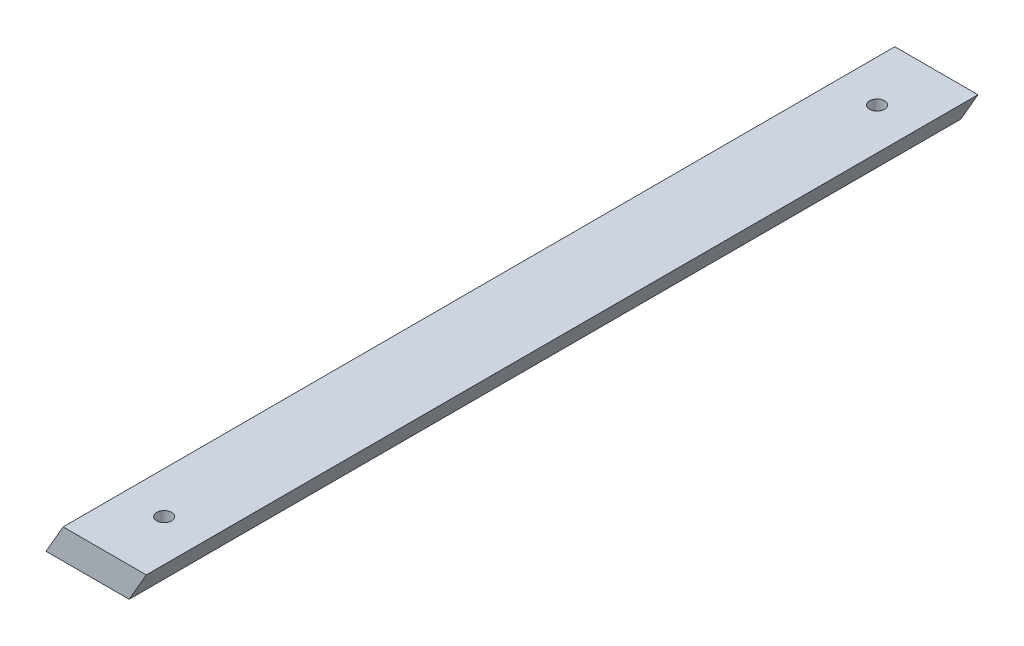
ISO-10303-21;
HEADER;
FILE_DESCRIPTION(('STEP AP214'),'2;1');
FILE_NAME('part.step','',(''),(''),'','','');
FILE_SCHEMA(('AUTOMOTIVE_DESIGN { 1 0 10303 214 1 1 1 1 }'));
ENDSEC;
DATA;
#1=APPLICATION_CONTEXT('core data for automotive mechanical design processes');
#2=APPLICATION_PROTOCOL_DEFINITION('international standard','automotive_design',2000,#1);
#3=PRODUCT_CONTEXT('',#1,'mechanical');
#4=PRODUCT('Part','Part','',(#3));
#5=PRODUCT_RELATED_PRODUCT_CATEGORY('part','',(#4));
#6=PRODUCT_DEFINITION_FORMATION('','',#4);
#7=PRODUCT_DEFINITION_CONTEXT('part definition',#1,'design');
#8=PRODUCT_DEFINITION('design','',#6,#7);
#9=PRODUCT_DEFINITION_SHAPE('','',#8);
#10=(LENGTH_UNIT() NAMED_UNIT(*) SI_UNIT(.MILLI.,.METRE.));
#11=(NAMED_UNIT(*) PLANE_ANGLE_UNIT() SI_UNIT($,.RADIAN.));
#12=(NAMED_UNIT(*) SI_UNIT($,.STERADIAN.) SOLID_ANGLE_UNIT());
#13=UNCERTAINTY_MEASURE_WITH_UNIT(LENGTH_MEASURE(1.E-05),#10,'distance_accuracy_value','');
#14=(GEOMETRIC_REPRESENTATION_CONTEXT(3) GLOBAL_UNCERTAINTY_ASSIGNED_CONTEXT((#13)) GLOBAL_UNIT_ASSIGNED_CONTEXT((#10,
#11,#12)) REPRESENTATION_CONTEXT('',''));
#15=CARTESIAN_POINT('',(0.,0.,0.));
#16=DIRECTION('',(0.,0.,1.));
#17=DIRECTION('',(1.,0.,0.));
#18=AXIS2_PLACEMENT_3D('',#15,#16,#17);
#19=CARTESIAN_POINT('',(0.,-5.,140.));
#20=DIRECTION('',(0.,1.,0.));
#21=DIRECTION('',(0.,0.,1.));
#22=AXIS2_PLACEMENT_3D('',#19,#20,#21);
#23=PLANE('',#22);
#24=DIRECTION('',(1.,0.,0.));
#25=VECTOR('',#24,1.);
#26=CARTESIAN_POINT('',(0.,-5.,-140.));
#27=LINE('',#26,#25);
#28=CARTESIAN_POINT('',(-19.7735026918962,-5.,-140.));
#29=VERTEX_POINT('',#28);
#30=CARTESIAN_POINT('',(8.22649730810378,-5.,-140.));
#31=VERTEX_POINT('',#30);
#32=EDGE_CURVE('E88',#29,#31,#27,.T.);
#33=ORIENTED_EDGE('',*,*,#32,.T.);
#34=DIRECTION('',(0.,0.,-1.));
#35=VECTOR('',#34,1.);
#36=CARTESIAN_POINT('',(8.22649730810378,-5.,140.));
#37=LINE('',#36,#35);
#38=CARTESIAN_POINT('',(8.22649730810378,-5.,140.));
#39=VERTEX_POINT('',#38);
#40=EDGE_CURVE('E44',#39,#31,#37,.T.);
#41=ORIENTED_EDGE('',*,*,#40,.F.);
#42=DIRECTION('',(1.,0.,0.));
#43=VECTOR('',#42,1.);
#44=CARTESIAN_POINT('',(0.,-5.,140.));
#45=LINE('',#44,#43);
#46=CARTESIAN_POINT('',(-19.7735026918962,-5.,140.));
#47=VERTEX_POINT('',#46);
#48=EDGE_CURVE('E78',#47,#39,#45,.T.);
#49=ORIENTED_EDGE('',*,*,#48,.F.);
#50=DIRECTION('',(0.,0.,-1.));
#51=VECTOR('',#50,1.);
#52=CARTESIAN_POINT('',(-19.7735026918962,-5.,140.));
#53=LINE('',#52,#51);
#54=EDGE_CURVE('E11',#47,#29,#53,.T.);
#55=ORIENTED_EDGE('',*,*,#54,.T.);
#56=EDGE_LOOP('',(#33,#41,#49,#55));
#57=FACE_BOUND('',#56,.T.);
#58=CARTESIAN_POINT('',(0.,-5.,120.));
#59=DIRECTION('',(0.,1.,0.));
#60=DIRECTION('',(-1.,0.,0.));
#61=AXIS2_PLACEMENT_3D('',#58,#59,#60);
#62=CIRCLE('',#61,2.5);
#63=CARTESIAN_POINT('',(-2.5,-5.,120.));
#64=VERTEX_POINT('',#63);
#65=EDGE_CURVE('E101',#64,#64,#62,.T.);
#66=ORIENTED_EDGE('',*,*,#65,.T.);
#67=EDGE_LOOP('',(#66));
#68=FACE_BOUND('',#67,.T.);
#69=CARTESIAN_POINT('',(0.,-5.00000000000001,-120.));
#70=DIRECTION('',(0.,-1.,0.));
#71=DIRECTION('',(-1.,0.,0.));
#72=AXIS2_PLACEMENT_3D('',#69,#70,#71);
#73=CIRCLE('',#72,2.5);
#74=CARTESIAN_POINT('',(-2.5,-5.00000000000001,-120.));
#75=VERTEX_POINT('',#74);
#76=EDGE_CURVE('E190',#75,#75,#73,.T.);
#77=ORIENTED_EDGE('',*,*,#76,.F.);
#78=EDGE_LOOP('',(#77));
#79=FACE_BOUND('',#78,.T.);
#80=ADVANCED_FACE('F35',(#57,#68,#79),#23,.F.);
#81=CARTESIAN_POINT('',(0.,5.,140.));
#82=DIRECTION('',(0.,-1.,0.));
#83=DIRECTION('',(1.,0.,0.));
#84=AXIS2_PLACEMENT_3D('',#81,#82,#83);
#85=PLANE('',#84);
#86=DIRECTION('',(-1.,0.,0.));
#87=VECTOR('',#86,1.);
#88=CARTESIAN_POINT('',(0.,5.,-140.));
#89=LINE('',#88,#87);
#90=CARTESIAN_POINT('',(14.,5.,-140.));
#91=VERTEX_POINT('',#90);
#92=CARTESIAN_POINT('',(-14.,5.,-140.));
#93=VERTEX_POINT('',#92);
#94=EDGE_CURVE('E71',#91,#93,#89,.T.);
#95=ORIENTED_EDGE('',*,*,#94,.T.);
#96=DIRECTION('',(0.,0.,-1.));
#97=VECTOR('',#96,1.);
#98=CARTESIAN_POINT('',(-14.,5.,140.));
#99=LINE('',#98,#97);
#100=CARTESIAN_POINT('',(-14.,5.,140.));
#101=VERTEX_POINT('',#100);
#102=EDGE_CURVE('E94',#101,#93,#99,.T.);
#103=ORIENTED_EDGE('',*,*,#102,.F.);
#104=DIRECTION('',(-1.,0.,0.));
#105=VECTOR('',#104,1.);
#106=CARTESIAN_POINT('',(0.,5.,140.));
#107=LINE('',#106,#105);
#108=CARTESIAN_POINT('',(14.,5.,140.));
#109=VERTEX_POINT('',#108);
#110=EDGE_CURVE('E52',#109,#101,#107,.T.);
#111=ORIENTED_EDGE('',*,*,#110,.F.);
#112=DIRECTION('',(0.,0.,-1.));
#113=VECTOR('',#112,1.);
#114=CARTESIAN_POINT('',(14.,5.,140.));
#115=LINE('',#114,#113);
#116=EDGE_CURVE('E68',#109,#91,#115,.T.);
#117=ORIENTED_EDGE('',*,*,#116,.T.);
#118=EDGE_LOOP('',(#95,#103,#111,#117));
#119=FACE_BOUND('',#118,.T.);
#120=CARTESIAN_POINT('',(0.,5.,120.));
#121=DIRECTION('',(0.,1.,0.));
#122=DIRECTION('',(-1.,0.,0.));
#123=AXIS2_PLACEMENT_3D('',#120,#121,#122);
#124=CIRCLE('',#123,2.5);
#125=CARTESIAN_POINT('',(-2.5,5.,120.));
#126=VERTEX_POINT('',#125);
#127=EDGE_CURVE('E196',#126,#126,#124,.T.);
#128=ORIENTED_EDGE('',*,*,#127,.F.);
#129=EDGE_LOOP('',(#128));
#130=FACE_BOUND('',#129,.T.);
#131=CARTESIAN_POINT('',(0.,5.,-120.));
#132=DIRECTION('',(0.,-1.,0.));
#133=DIRECTION('',(-1.,0.,0.));
#134=AXIS2_PLACEMENT_3D('',#131,#132,#133);
#135=CIRCLE('',#134,2.5);
#136=CARTESIAN_POINT('',(-2.5,5.,-120.));
#137=VERTEX_POINT('',#136);
#138=EDGE_CURVE('E193',#137,#137,#135,.T.);
#139=ORIENTED_EDGE('',*,*,#138,.T.);
#140=EDGE_LOOP('',(#139));
#141=FACE_BOUND('',#140,.T.);
#142=ADVANCED_FACE('F124',(#119,#130,#141),#85,.F.);
#143=CARTESIAN_POINT('',(-12.6650635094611,7.31217782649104,140.));
#144=DIRECTION('',(0.86602540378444,-0.499999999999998,0.));
#145=DIRECTION('',(0.499999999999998,0.86602540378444,0.));
#146=AXIS2_PLACEMENT_3D('',#143,#144,#145);
#147=PLANE('',#146);
#148=DIRECTION('',(-0.499999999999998,-0.86602540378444,0.));
#149=VECTOR('',#148,1.);
#150=CARTESIAN_POINT('',(-12.6650635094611,7.31217782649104,-140.));
#151=LINE('',#150,#149);
#152=EDGE_CURVE('E98',#93,#29,#151,.T.);
#153=ORIENTED_EDGE('',*,*,#152,.T.);
#154=ORIENTED_EDGE('',*,*,#54,.F.);
#155=DIRECTION('',(-0.499999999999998,-0.86602540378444,0.));
#156=VECTOR('',#155,1.);
#157=CARTESIAN_POINT('',(-12.6650635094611,7.31217782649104,140.));
#158=LINE('',#157,#156);
#159=EDGE_CURVE('E83',#101,#47,#158,.T.);
#160=ORIENTED_EDGE('',*,*,#159,.F.);
#161=ORIENTED_EDGE('',*,*,#102,.T.);
#162=EDGE_LOOP('',(#153,#154,#160,#161));
#163=FACE_BOUND('',#162,.T.);
#164=ADVANCED_FACE('F37',(#163),#147,.F.);
#165=CARTESIAN_POINT('',(8.33493649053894,-4.81217782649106,140.));
#166=DIRECTION('',(0.86602540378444,-0.499999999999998,0.));
#167=DIRECTION('',(0.499999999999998,0.86602540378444,0.));
#168=AXIS2_PLACEMENT_3D('',#165,#166,#167);
#169=PLANE('',#168);
#170=DIRECTION('',(-0.499999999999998,-0.86602540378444,0.));
#171=VECTOR('',#170,1.);
#172=CARTESIAN_POINT('',(8.33493649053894,-4.81217782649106,-140.));
#173=LINE('',#172,#171);
#174=EDGE_CURVE('E103',#91,#31,#173,.T.);
#175=ORIENTED_EDGE('',*,*,#174,.F.);
#176=ORIENTED_EDGE('',*,*,#116,.F.);
#177=DIRECTION('',(-0.499999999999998,-0.86602540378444,0.));
#178=VECTOR('',#177,1.);
#179=CARTESIAN_POINT('',(8.33493649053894,-4.81217782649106,140.));
#180=LINE('',#179,#178);
#181=EDGE_CURVE('E81',#109,#39,#180,.T.);
#182=ORIENTED_EDGE('',*,*,#181,.T.);
#183=ORIENTED_EDGE('',*,*,#40,.T.);
#184=EDGE_LOOP('',(#175,#176,#182,#183));
#185=FACE_BOUND('',#184,.T.);
#186=ADVANCED_FACE('F92',(#185),#169,.T.);
#187=CARTESIAN_POINT('',(0.,0.,140.));
#188=DIRECTION('',(0.,0.,1.));
#189=DIRECTION('',(1.,0.,0.));
#190=AXIS2_PLACEMENT_3D('',#187,#188,#189);
#191=PLANE('',#190);
#192=ORIENTED_EDGE('',*,*,#159,.T.);
#193=ORIENTED_EDGE('',*,*,#48,.T.);
#194=ORIENTED_EDGE('',*,*,#181,.F.);
#195=ORIENTED_EDGE('',*,*,#110,.T.);
#196=EDGE_LOOP('',(#192,#193,#194,#195));
#197=FACE_BOUND('',#196,.T.);
#198=ADVANCED_FACE('F79',(#197),#191,.T.);
#199=CARTESIAN_POINT('',(0.,0.,-140.));
#200=DIRECTION('',(0.,0.,1.));
#201=DIRECTION('',(1.,0.,0.));
#202=AXIS2_PLACEMENT_3D('',#199,#200,#201);
#203=PLANE('',#202);
#204=ORIENTED_EDGE('',*,*,#152,.F.);
#205=ORIENTED_EDGE('',*,*,#94,.F.);
#206=ORIENTED_EDGE('',*,*,#174,.T.);
#207=ORIENTED_EDGE('',*,*,#32,.F.);
#208=EDGE_LOOP('',(#204,#205,#206,#207));
#209=FACE_BOUND('',#208,.T.);
#210=ADVANCED_FACE('F110',(#209),#203,.F.);
#211=CARTESIAN_POINT('',(0.,-5.,120.));
#212=DIRECTION('',(0.,1.,0.));
#213=DIRECTION('',(-1.,0.,0.));
#214=AXIS2_PLACEMENT_3D('',#211,#212,#213);
#215=CYLINDRICAL_SURFACE('',#214,2.5);
#216=ORIENTED_EDGE('',*,*,#65,.F.);
#217=EDGE_LOOP('',(#216));
#218=FACE_BOUND('',#217,.T.);
#219=ORIENTED_EDGE('',*,*,#127,.T.);
#220=EDGE_LOOP('',(#219));
#221=FACE_BOUND('',#220,.T.);
#222=ADVANCED_FACE('F112',(#218,#221),#215,.F.);
#223=CARTESIAN_POINT('',(0.,-5.00000000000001,-120.));
#224=DIRECTION('',(0.,1.,0.));
#225=DIRECTION('',(-1.,0.,0.));
#226=AXIS2_PLACEMENT_3D('',#223,#224,#225);
#227=CYLINDRICAL_SURFACE('',#226,2.5);
#228=ORIENTED_EDGE('',*,*,#76,.T.);
#229=EDGE_LOOP('',(#228));
#230=FACE_BOUND('',#229,.T.);
#231=ORIENTED_EDGE('',*,*,#138,.F.);
#232=EDGE_LOOP('',(#231));
#233=FACE_BOUND('',#232,.T.);
#234=ADVANCED_FACE('F118',(#230,#233),#227,.F.);
#235=CLOSED_SHELL('',(#80,#142,#164,#186,#198,#210,#222,#234));
#236=MANIFOLD_SOLID_BREP('B2',#235);
#237=ADVANCED_BREP_SHAPE_REPRESENTATION('',(#18,#236),#14);
#238=SHAPE_DEFINITION_REPRESENTATION(#9,#237);
ENDSEC;
END-ISO-10303-21;
